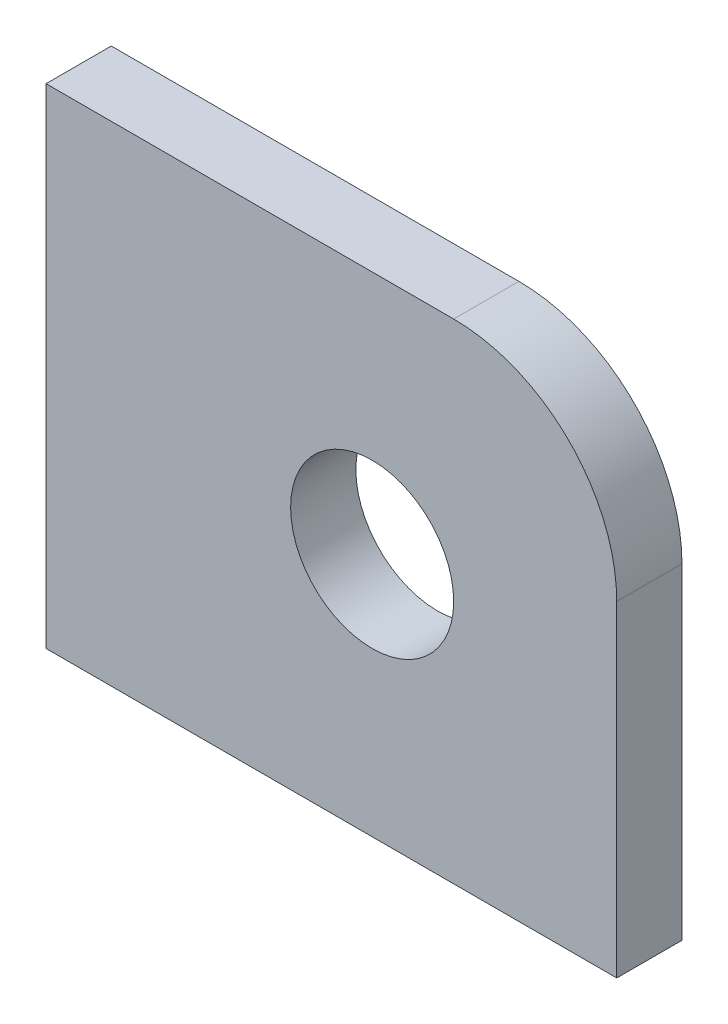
ISO-10303-21;
HEADER;
FILE_DESCRIPTION(('STEP AP214'),'2;1');
FILE_NAME('part.step','',(''),(''),'','','');
FILE_SCHEMA(('AUTOMOTIVE_DESIGN { 1 0 10303 214 1 1 1 1 }'));
ENDSEC;
DATA;
#1=APPLICATION_CONTEXT('core data for automotive mechanical design processes');
#2=APPLICATION_PROTOCOL_DEFINITION('international standard','automotive_design',2000,#1);
#3=PRODUCT_CONTEXT('',#1,'mechanical');
#4=PRODUCT('Part','Part','',(#3));
#5=PRODUCT_RELATED_PRODUCT_CATEGORY('part','',(#4));
#6=PRODUCT_DEFINITION_FORMATION('','',#4);
#7=PRODUCT_DEFINITION_CONTEXT('part definition',#1,'design');
#8=PRODUCT_DEFINITION('design','',#6,#7);
#9=PRODUCT_DEFINITION_SHAPE('','',#8);
#10=(LENGTH_UNIT() NAMED_UNIT(*) SI_UNIT(.MILLI.,.METRE.));
#11=(NAMED_UNIT(*) PLANE_ANGLE_UNIT() SI_UNIT($,.RADIAN.));
#12=(NAMED_UNIT(*) SI_UNIT($,.STERADIAN.) SOLID_ANGLE_UNIT());
#13=UNCERTAINTY_MEASURE_WITH_UNIT(LENGTH_MEASURE(1.E-05),#10,'distance_accuracy_value','');
#14=(GEOMETRIC_REPRESENTATION_CONTEXT(3) GLOBAL_UNCERTAINTY_ASSIGNED_CONTEXT((#13)) GLOBAL_UNIT_ASSIGNED_CONTEXT((#10,
#11,#12)) REPRESENTATION_CONTEXT('',''));
#15=CARTESIAN_POINT('',(0.,0.,0.));
#16=DIRECTION('',(0.,0.,1.));
#17=DIRECTION('',(1.,0.,0.));
#18=AXIS2_PLACEMENT_3D('',#15,#16,#17);
#19=CARTESIAN_POINT('',(49.9999999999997,40.,8.00000000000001));
#20=DIRECTION('',(0.,0.,1.));
#21=DIRECTION('',(1.,0.,0.));
#22=AXIS2_PLACEMENT_3D('',#19,#20,#21);
#23=PLANE('',#22);
#24=DIRECTION('',(0.,-1.,0.));
#25=VECTOR('',#24,1.);
#26=CARTESIAN_POINT('',(-1.11022302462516E-13,0.,8.00000000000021));
#27=LINE('',#26,#25);
#28=CARTESIAN_POINT('',(-3.67761376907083E-13,60.0000000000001,8.00000000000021));
#29=VERTEX_POINT('',#28);
#30=CARTESIAN_POINT('',(-1.11022302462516E-13,0.,8.00000000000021));
#31=VERTEX_POINT('',#30);
#32=EDGE_CURVE('E107',#29,#31,#27,.T.);
#33=ORIENTED_EDGE('',*,*,#32,.T.);
#34=DIRECTION('',(1.,0.,0.));
#35=VECTOR('',#34,1.);
#36=CARTESIAN_POINT('',(-1.11022302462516E-13,0.,8.00000000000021));
#37=LINE('',#36,#35);
#38=CARTESIAN_POINT('',(70.,0.,8.00000000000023));
#39=VERTEX_POINT('',#38);
#40=EDGE_CURVE('E90',#31,#39,#37,.T.);
#41=ORIENTED_EDGE('',*,*,#40,.T.);
#42=DIRECTION('',(0.,1.,0.));
#43=VECTOR('',#42,1.);
#44=CARTESIAN_POINT('',(70.,0.,8.00000000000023));
#45=LINE('',#44,#43);
#46=CARTESIAN_POINT('',(70.,40.,8.00000000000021));
#47=VERTEX_POINT('',#46);
#48=EDGE_CURVE('E110',#39,#47,#45,.T.);
#49=ORIENTED_EDGE('',*,*,#48,.T.);
#50=CARTESIAN_POINT('',(49.9999999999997,40.,8.00000000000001));
#51=DIRECTION('',(0.,0.,1.));
#52=DIRECTION('',(1.,0.,0.));
#53=AXIS2_PLACEMENT_3D('',#50,#51,#52);
#54=CIRCLE('',#53,20.);
#55=CARTESIAN_POINT('',(49.9999999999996,60.0000000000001,8.00000000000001));
#56=VERTEX_POINT('',#55);
#57=EDGE_CURVE('E49',#47,#56,#54,.T.);
#58=ORIENTED_EDGE('',*,*,#57,.T.);
#59=DIRECTION('',(-1.,0.,0.));
#60=VECTOR('',#59,1.);
#61=CARTESIAN_POINT('',(-3.67761376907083E-13,60.0000000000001,8.00000000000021));
#62=LINE('',#61,#60);
#63=EDGE_CURVE('E44',#56,#29,#62,.T.);
#64=ORIENTED_EDGE('',*,*,#63,.T.);
#65=EDGE_LOOP('',(#33,#41,#49,#58,#64));
#66=FACE_BOUND('',#65,.T.);
#67=CARTESIAN_POINT('',(39.9999999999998,30.,8.00000000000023));
#68=DIRECTION('',(0.,0.,1.));
#69=DIRECTION('',(1.,0.,0.));
#70=AXIS2_PLACEMENT_3D('',#67,#68,#69);
#71=CIRCLE('',#70,10.);
#72=CARTESIAN_POINT('',(49.9999999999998,30.,8.00000000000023));
#73=VERTEX_POINT('',#72);
#74=EDGE_CURVE('E95',#73,#73,#71,.T.);
#75=ORIENTED_EDGE('',*,*,#74,.F.);
#76=EDGE_LOOP('',(#75));
#77=FACE_BOUND('',#76,.T.);
#78=ADVANCED_FACE('F29',(#66,#77),#23,.T.);
#79=CARTESIAN_POINT('',(49.9999999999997,40.,0.));
#80=DIRECTION('',(0.,0.,1.));
#81=DIRECTION('',(1.,0.,0.));
#82=AXIS2_PLACEMENT_3D('',#79,#80,#81);
#83=PLANE('',#82);
#84=DIRECTION('',(0.,-1.,0.));
#85=VECTOR('',#84,1.);
#86=CARTESIAN_POINT('',(-1.11022302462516E-13,0.,2.22044604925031E-13));
#87=LINE('',#86,#85);
#88=CARTESIAN_POINT('',(-2.56739074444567E-13,60.0000000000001,2.4980018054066E-13));
#89=VERTEX_POINT('',#88);
#90=CARTESIAN_POINT('',(-1.11022302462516E-13,0.,2.22044604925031E-13));
#91=VERTEX_POINT('',#90);
#92=EDGE_CURVE('E81',#89,#91,#87,.T.);
#93=ORIENTED_EDGE('',*,*,#92,.F.);
#94=DIRECTION('',(-1.,0.,0.));
#95=VECTOR('',#94,1.);
#96=CARTESIAN_POINT('',(-2.56739074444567E-13,60.0000000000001,2.4980018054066E-13));
#97=LINE('',#96,#95);
#98=CARTESIAN_POINT('',(49.9999999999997,60.0000000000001,0.));
#99=VERTEX_POINT('',#98);
#100=EDGE_CURVE('E105',#99,#89,#97,.T.);
#101=ORIENTED_EDGE('',*,*,#100,.F.);
#102=CARTESIAN_POINT('',(49.9999999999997,40.,0.));
#103=DIRECTION('',(0.,0.,1.));
#104=DIRECTION('',(1.,0.,0.));
#105=AXIS2_PLACEMENT_3D('',#102,#103,#104);
#106=CIRCLE('',#105,20.);
#107=CARTESIAN_POINT('',(70.,40.,2.22044604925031E-13));
#108=VERTEX_POINT('',#107);
#109=EDGE_CURVE('E103',#108,#99,#106,.T.);
#110=ORIENTED_EDGE('',*,*,#109,.F.);
#111=DIRECTION('',(0.,1.,0.));
#112=VECTOR('',#111,1.);
#113=CARTESIAN_POINT('',(70.,0.,1.66533453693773E-13));
#114=LINE('',#113,#112);
#115=CARTESIAN_POINT('',(70.,0.,1.66533453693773E-13));
#116=VERTEX_POINT('',#115);
#117=EDGE_CURVE('E83',#116,#108,#114,.T.);
#118=ORIENTED_EDGE('',*,*,#117,.F.);
#119=DIRECTION('',(1.,0.,0.));
#120=VECTOR('',#119,1.);
#121=CARTESIAN_POINT('',(-1.11022302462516E-13,0.,2.22044604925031E-13));
#122=LINE('',#121,#120);
#123=EDGE_CURVE('E76',#91,#116,#122,.T.);
#124=ORIENTED_EDGE('',*,*,#123,.F.);
#125=EDGE_LOOP('',(#93,#101,#110,#118,#124));
#126=FACE_BOUND('',#125,.T.);
#127=CARTESIAN_POINT('',(39.9999999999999,30.,2.22044604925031E-13));
#128=DIRECTION('',(0.,0.,1.));
#129=DIRECTION('',(1.,0.,0.));
#130=AXIS2_PLACEMENT_3D('',#127,#128,#129);
#131=CIRCLE('',#130,10.);
#132=CARTESIAN_POINT('',(49.9999999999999,30.,2.27034470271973E-13));
#133=VERTEX_POINT('',#132);
#134=EDGE_CURVE('E98',#133,#133,#131,.T.);
#135=ORIENTED_EDGE('',*,*,#134,.T.);
#136=EDGE_LOOP('',(#135));
#137=FACE_BOUND('',#136,.T.);
#138=ADVANCED_FACE('F77',(#126,#137),#83,.F.);
#139=CARTESIAN_POINT('',(-1.11022302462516E-13,0.,8.00000000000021));
#140=DIRECTION('',(1.,0.,0.));
#141=DIRECTION('',(0.,0.,-1.));
#142=AXIS2_PLACEMENT_3D('',#139,#140,#141);
#143=PLANE('',#142);
#144=ORIENTED_EDGE('',*,*,#92,.T.);
#145=DIRECTION('',(0.,0.,-1.));
#146=VECTOR('',#145,1.);
#147=CARTESIAN_POINT('',(-1.11022302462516E-13,0.,8.00000000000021));
#148=LINE('',#147,#146);
#149=EDGE_CURVE('E11',#31,#91,#148,.T.);
#150=ORIENTED_EDGE('',*,*,#149,.F.);
#151=ORIENTED_EDGE('',*,*,#32,.F.);
#152=DIRECTION('',(0.,0.,-1.));
#153=VECTOR('',#152,1.);
#154=CARTESIAN_POINT('',(-3.67761376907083E-13,60.0000000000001,8.00000000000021));
#155=LINE('',#154,#153);
#156=EDGE_CURVE('E94',#29,#89,#155,.T.);
#157=ORIENTED_EDGE('',*,*,#156,.T.);
#158=EDGE_LOOP('',(#144,#150,#151,#157));
#159=FACE_BOUND('',#158,.T.);
#160=ADVANCED_FACE('F31',(#159),#143,.F.);
#161=CARTESIAN_POINT('',(-1.11022302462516E-13,0.,8.00000000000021));
#162=DIRECTION('',(0.,1.,0.));
#163=DIRECTION('',(0.,0.,1.));
#164=AXIS2_PLACEMENT_3D('',#161,#162,#163);
#165=PLANE('',#164);
#166=ORIENTED_EDGE('',*,*,#123,.T.);
#167=DIRECTION('',(0.,0.,-1.));
#168=VECTOR('',#167,1.);
#169=CARTESIAN_POINT('',(70.,0.,8.00000000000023));
#170=LINE('',#169,#168);
#171=EDGE_CURVE('E37',#39,#116,#170,.T.);
#172=ORIENTED_EDGE('',*,*,#171,.F.);
#173=ORIENTED_EDGE('',*,*,#40,.F.);
#174=ORIENTED_EDGE('',*,*,#149,.T.);
#175=EDGE_LOOP('',(#166,#172,#173,#174));
#176=FACE_BOUND('',#175,.T.);
#177=ADVANCED_FACE('F89',(#176),#165,.F.);
#178=CARTESIAN_POINT('',(70.,0.,8.00000000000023));
#179=DIRECTION('',(-1.,0.,0.));
#180=DIRECTION('',(0.,0.,1.));
#181=AXIS2_PLACEMENT_3D('',#178,#179,#180);
#182=PLANE('',#181);
#183=ORIENTED_EDGE('',*,*,#117,.T.);
#184=DIRECTION('',(0.,0.,-1.));
#185=VECTOR('',#184,1.);
#186=CARTESIAN_POINT('',(70.,40.,8.00000000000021));
#187=LINE('',#186,#185);
#188=EDGE_CURVE('E118',#47,#108,#187,.T.);
#189=ORIENTED_EDGE('',*,*,#188,.F.);
#190=ORIENTED_EDGE('',*,*,#48,.F.);
#191=ORIENTED_EDGE('',*,*,#171,.T.);
#192=EDGE_LOOP('',(#183,#189,#190,#191));
#193=FACE_BOUND('',#192,.T.);
#194=ADVANCED_FACE('F122',(#193),#182,.F.);
#195=CARTESIAN_POINT('',(49.9999999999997,40.,8.00000000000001));
#196=DIRECTION('',(0.,0.,-1.));
#197=DIRECTION('',(-1.,0.,0.));
#198=AXIS2_PLACEMENT_3D('',#195,#196,#197);
#199=CYLINDRICAL_SURFACE('',#198,20.);
#200=ORIENTED_EDGE('',*,*,#109,.T.);
#201=DIRECTION('',(0.,0.,-1.));
#202=VECTOR('',#201,1.);
#203=CARTESIAN_POINT('',(49.9999999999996,60.0000000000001,8.00000000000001));
#204=LINE('',#203,#202);
#205=EDGE_CURVE('E115',#56,#99,#204,.T.);
#206=ORIENTED_EDGE('',*,*,#205,.F.);
#207=ORIENTED_EDGE('',*,*,#57,.F.);
#208=ORIENTED_EDGE('',*,*,#188,.T.);
#209=EDGE_LOOP('',(#200,#206,#207,#208));
#210=FACE_BOUND('',#209,.T.);
#211=ADVANCED_FACE('F144',(#210),#199,.T.);
#212=CARTESIAN_POINT('',(-3.67761376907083E-13,60.0000000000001,8.00000000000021));
#213=DIRECTION('',(0.,-1.,0.));
#214=DIRECTION('',(0.,0.,-1.));
#215=AXIS2_PLACEMENT_3D('',#212,#213,#214);
#216=PLANE('',#215);
#217=ORIENTED_EDGE('',*,*,#100,.T.);
#218=ORIENTED_EDGE('',*,*,#156,.F.);
#219=ORIENTED_EDGE('',*,*,#63,.F.);
#220=ORIENTED_EDGE('',*,*,#205,.T.);
#221=EDGE_LOOP('',(#217,#218,#219,#220));
#222=FACE_BOUND('',#221,.T.);
#223=ADVANCED_FACE('F132',(#222),#216,.F.);
#224=CARTESIAN_POINT('',(39.9999999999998,30.,8.00000000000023));
#225=DIRECTION('',(0.,0.,-1.));
#226=DIRECTION('',(-1.,0.,0.));
#227=AXIS2_PLACEMENT_3D('',#224,#225,#226);
#228=CYLINDRICAL_SURFACE('',#227,10.);
#229=ORIENTED_EDGE('',*,*,#74,.T.);
#230=EDGE_LOOP('',(#229));
#231=FACE_BOUND('',#230,.T.);
#232=ORIENTED_EDGE('',*,*,#134,.F.);
#233=EDGE_LOOP('',(#232));
#234=FACE_BOUND('',#233,.T.);
#235=ADVANCED_FACE('F129',(#231,#234),#228,.F.);
#236=CLOSED_SHELL('',(#78,#138,#160,#177,#194,#211,#223,#235));
#237=MANIFOLD_SOLID_BREP('B2',#236);
#238=ADVANCED_BREP_SHAPE_REPRESENTATION('',(#18,#237),#14);
#239=SHAPE_DEFINITION_REPRESENTATION(#9,#238);
ENDSEC;
END-ISO-10303-21;
